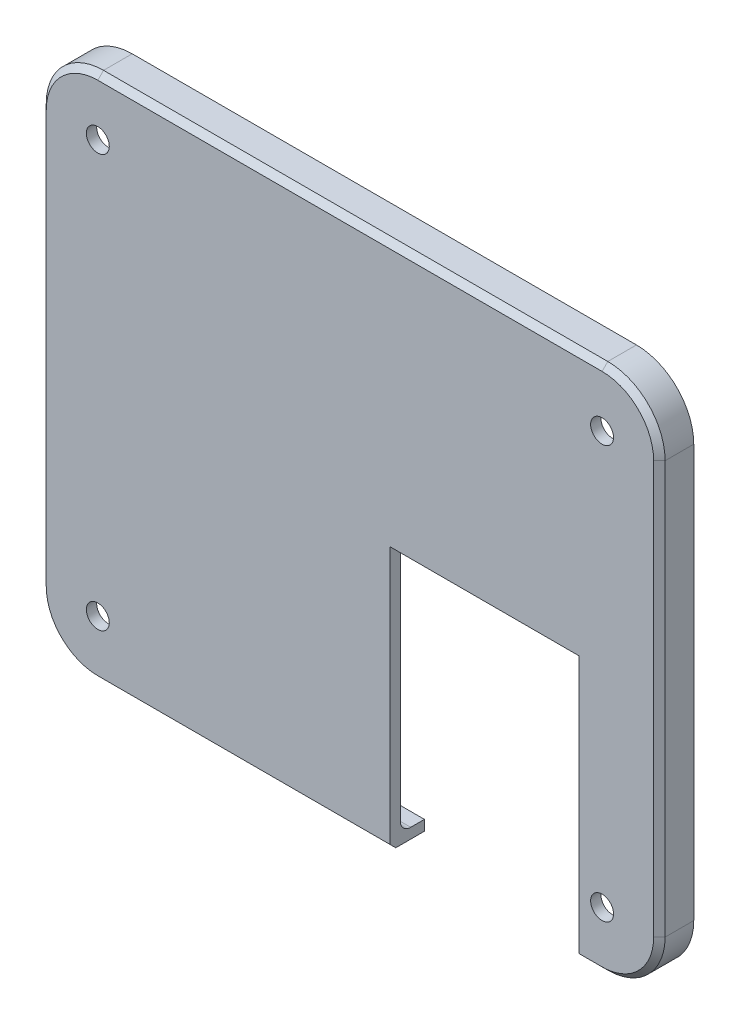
from build123d import *

# Parameters (mm, degrees)
ESQUISSE1_R             = 2
BOSS_EXTRU_1_DEPTH      = 6
COQUE1_T                = -1.8
ESQUISSE2_W             = 33
ESQUISSE2_H             = 46
ENL_V_MAT_EXTRU_1_DEPTH = 72.189886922
CHANFREIN1_SIZE         = 1
CONG_1_R                = 1.8


with BuildPart() as part:
    # Esquisse1 → Boss.-Extru.1 (new body)
    with BuildSketch(Plane.XY):
        with BuildLine():
            Line((44, -46), (-44, -46))
            ThreePointArc((-44, -46), (-51.071067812, -43.071067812), (-54, -36))
            Line((-54, -36), (-54, 36))
            ThreePointArc((-54, 36), (-51.071067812, 43.071067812), (-44, 46))
            Line((-44, 46), (44, 46))
            ThreePointArc((44, 46), (51.071067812, 43.071067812), (54, 36))
            Line((54, 36), (54, -36))
            ThreePointArc((54, -36), (51.071067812, -43.071067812), (44, -46))
        make_face()
        with Locations((-44, -36)):
            Circle(ESQUISSE1_R, mode=Mode.SUBTRACT)
        with Locations((44, -36)):
            Circle(ESQUISSE1_R, mode=Mode.SUBTRACT)
        with Locations((44, 36)):
            Circle(ESQUISSE1_R, mode=Mode.SUBTRACT)
        with Locations((-44, 36)):
            Circle(ESQUISSE1_R, mode=Mode.SUBTRACT)
    extrude(amount=BOSS_EXTRU_1_DEPTH)

    # Coque1
    coque1_openings = [part.faces().sort_by_distance(p)[0] for p in [
        (-46, -36, 3),
        (42, -36, 3),
        (42, 36, 3),
        (0, 0, 0),
        (-46, 36, 3),
    ]]
    offset(amount=COQUE1_T, openings=coque1_openings, kind=Kind.INTERSECTION)

    # Esquisse2 → Enl_v. mat.-Extru.1 (cut, through all)
    with BuildSketch(Plane.XY.offset(6)):
        with Locations((23.5, -23)):
            Rectangle(ESQUISSE2_W, ESQUISSE2_H)
    extrude(amount=-ENL_V_MAT_EXTRU_1_DEPTH, mode=Mode.SUBTRACT)

    # Chanfrein1
    chanfrein1_edges = [part.edges().sort_by_distance(p)[0] for p in [
        (51.071067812, -43.071067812, 6),
        (54, 0, 6),
        (51.071067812, 43.071067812, 6),
        (0, 46, 6),
        (-51.071067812, 43.071067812, 6),
        (-54, 0, 6),
        (-51.071067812, -43.071067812, 6),
        (-18.5, -46, 6),
        (42, -46, 6),
    ]]
    chamfer(chanfrein1_edges, length=CHANFREIN1_SIZE)

    # Cong_1
    cong_1_edges = [part.edges().sort_by_distance(p)[0] for p in [
        (-49.798275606, -41.798275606, 4.2),
        (-18.5, -44.2, 4.2),
        (49.798275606, -41.798275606, 4.2),
        (52.2, 0, 4.2),
        (49.798275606, 41.798275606, 4.2),
        (0, 44.2, 4.2),
        (-49.798275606, 41.798275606, 4.2),
        (-52.2, 0, 4.2),
        (42, -44.2, 4.2),
    ]]
    fillet(cong_1_edges, radius=CONG_1_R)


solid = part.part
